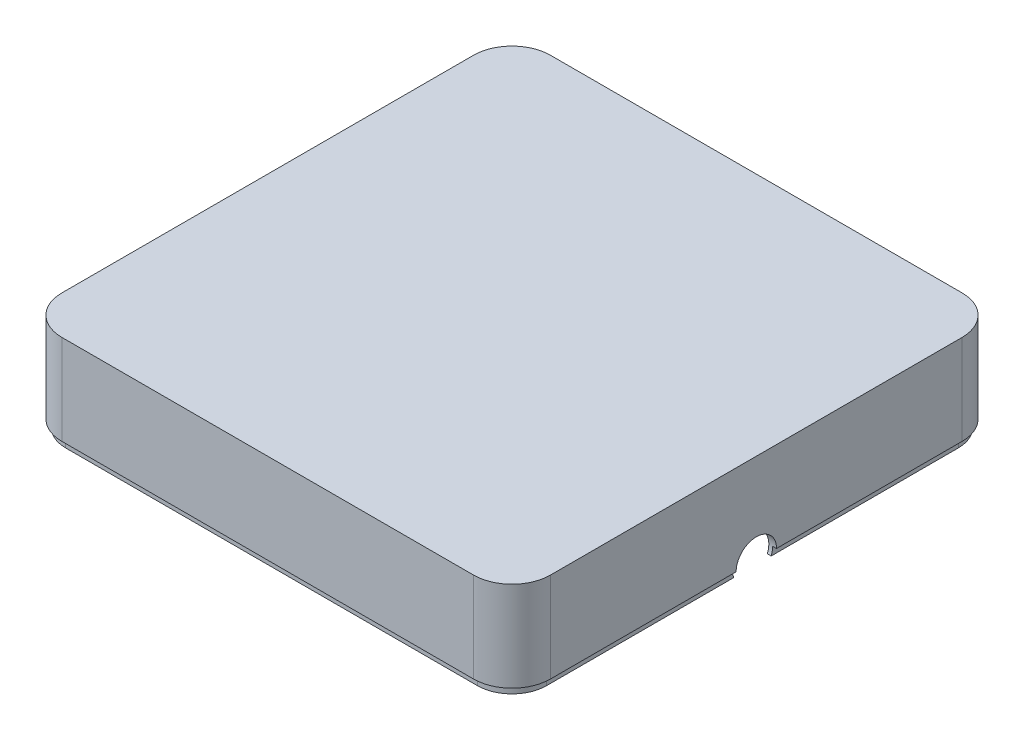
ISO-10303-21;
HEADER;
FILE_DESCRIPTION(('STEP AP214'),'2;1');
FILE_NAME('part.step','',(''),(''),'','','');
FILE_SCHEMA(('AUTOMOTIVE_DESIGN { 1 0 10303 214 1 1 1 1 }'));
ENDSEC;
DATA;
#1=APPLICATION_CONTEXT('core data for automotive mechanical design processes');
#2=APPLICATION_PROTOCOL_DEFINITION('international standard','automotive_design',2000,#1);
#3=PRODUCT_CONTEXT('',#1,'mechanical');
#4=PRODUCT('Part','Part','',(#3));
#5=PRODUCT_RELATED_PRODUCT_CATEGORY('part','',(#4));
#6=PRODUCT_DEFINITION_FORMATION('','',#4);
#7=PRODUCT_DEFINITION_CONTEXT('part definition',#1,'design');
#8=PRODUCT_DEFINITION('design','',#6,#7);
#9=PRODUCT_DEFINITION_SHAPE('','',#8);
#10=(LENGTH_UNIT() NAMED_UNIT(*) SI_UNIT(.MILLI.,.METRE.));
#11=(NAMED_UNIT(*) PLANE_ANGLE_UNIT() SI_UNIT($,.RADIAN.));
#12=(NAMED_UNIT(*) SI_UNIT($,.STERADIAN.) SOLID_ANGLE_UNIT());
#13=UNCERTAINTY_MEASURE_WITH_UNIT(LENGTH_MEASURE(1.E-05),#10,'distance_accuracy_value','');
#14=(GEOMETRIC_REPRESENTATION_CONTEXT(3) GLOBAL_UNCERTAINTY_ASSIGNED_CONTEXT((#13)) GLOBAL_UNIT_ASSIGNED_CONTEXT((#10,
#11,#12)) REPRESENTATION_CONTEXT('',''));
#15=CARTESIAN_POINT('',(0.,0.,0.));
#16=DIRECTION('',(0.,0.,1.));
#17=DIRECTION('',(1.,0.,0.));
#18=AXIS2_PLACEMENT_3D('',#15,#16,#17);
#19=CARTESIAN_POINT('',(0.,-25.4,127.));
#20=DIRECTION('',(0.,1.,0.));
#21=DIRECTION('',(0.,0.,1.));
#22=AXIS2_PLACEMENT_3D('',#19,#20,#21);
#23=PLANE('',#22);
#24=DIRECTION('',(1.,0.,0.));
#25=VECTOR('',#24,1.);
#26=CARTESIAN_POINT('',(0.,-25.4,2.));
#27=LINE('',#26,#25);
#28=CARTESIAN_POINT('',(38.214826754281,-25.4,2.));
#29=VERTEX_POINT('',#28);
#30=CARTESIAN_POINT('',(117.,-25.4,2.));
#31=VERTEX_POINT('',#30);
#32=EDGE_CURVE('E354',#29,#31,#27,.T.);
#33=ORIENTED_EDGE('',*,*,#32,.F.);
#34=DIRECTION('',(0.,0.,1.));
#35=VECTOR('',#34,1.);
#36=CARTESIAN_POINT('',(38.214826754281,-25.4,127.001));
#37=LINE('',#36,#35);
#38=CARTESIAN_POINT('',(38.214826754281,-25.4,1.));
#39=VERTEX_POINT('',#38);
#40=EDGE_CURVE('E506',#39,#29,#37,.T.);
#41=ORIENTED_EDGE('',*,*,#40,.F.);
#42=DIRECTION('',(1.,0.,0.));
#43=VECTOR('',#42,1.);
#44=CARTESIAN_POINT('',(10.,-25.4,1.));
#45=LINE('',#44,#43);
#46=CARTESIAN_POINT('',(117.,-25.4,1.));
#47=VERTEX_POINT('',#46);
#48=EDGE_CURVE('E308',#39,#47,#45,.T.);
#49=ORIENTED_EDGE('',*,*,#48,.T.);
#50=CARTESIAN_POINT('',(117.,-25.4,9.99999999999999));
#51=DIRECTION('',(0.,-1.,0.));
#52=DIRECTION('',(0.,0.,-1.));
#53=AXIS2_PLACEMENT_3D('',#50,#51,#52);
#54=CIRCLE('',#53,8.99999999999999);
#55=CARTESIAN_POINT('',(126.,-25.4,9.99999999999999));
#56=VERTEX_POINT('',#55);
#57=EDGE_CURVE('E311',#47,#56,#54,.T.);
#58=ORIENTED_EDGE('',*,*,#57,.T.);
#59=DIRECTION('',(0.,0.,1.));
#60=VECTOR('',#59,1.);
#61=CARTESIAN_POINT('',(126.,-25.4,9.99999999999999));
#62=LINE('',#61,#60);
#63=CARTESIAN_POINT('',(126.,-25.4,58.6458780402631));
#64=VERTEX_POINT('',#63);
#65=EDGE_CURVE('E315',#56,#64,#62,.T.);
#66=ORIENTED_EDGE('',*,*,#65,.T.);
#67=DIRECTION('',(1.,0.,0.));
#68=VECTOR('',#67,1.);
#69=CARTESIAN_POINT('',(123.,-25.4,58.6458780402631));
#70=LINE('',#69,#68);
#71=CARTESIAN_POINT('',(125.,-25.4,58.6458780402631));
#72=VERTEX_POINT('',#71);
#73=EDGE_CURVE('E516',#64,#72,#70,.F.);
#74=ORIENTED_EDGE('',*,*,#73,.T.);
#75=DIRECTION('',(0.,0.,-1.));
#76=VECTOR('',#75,1.);
#77=CARTESIAN_POINT('',(125.,-25.4,127.));
#78=LINE('',#77,#76);
#79=CARTESIAN_POINT('',(125.,-25.4,9.99999999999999));
#80=VERTEX_POINT('',#79);
#81=EDGE_CURVE('E377',#72,#80,#78,.T.);
#82=ORIENTED_EDGE('',*,*,#81,.T.);
#83=CARTESIAN_POINT('',(117.,-25.4,9.99999999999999));
#84=DIRECTION('',(0.,1.,0.));
#85=DIRECTION('',(0.,0.,1.));
#86=AXIS2_PLACEMENT_3D('',#83,#84,#85);
#87=CIRCLE('',#86,8.);
#88=EDGE_CURVE('E407',#31,#80,#87,.F.);
#89=ORIENTED_EDGE('',*,*,#88,.F.);
#90=EDGE_LOOP('',(#33,#41,#49,#58,#66,#74,#82,#89));
#91=FACE_BOUND('',#90,.T.);
#92=ADVANCED_FACE('F35',(#91),#23,.F.);
#93=CARTESIAN_POINT('',(117.,-23.4,117.));
#94=DIRECTION('',(0.,-1.,0.));
#95=DIRECTION('',(0.,0.,-1.));
#96=AXIS2_PLACEMENT_3D('',#93,#94,#95);
#97=PLANE('',#96);
#98=DIRECTION('',(0.,0.,-1.));
#99=VECTOR('',#98,1.);
#100=CARTESIAN_POINT('',(38.214826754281,-23.4,127.001));
#101=LINE('',#100,#99);
#102=CARTESIAN_POINT('',(38.214826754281,-23.4,1.));
#103=VERTEX_POINT('',#102);
#104=CARTESIAN_POINT('',(38.214826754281,-23.4,0.));
#105=VERTEX_POINT('',#104);
#106=EDGE_CURVE('E274',#103,#105,#101,.T.);
#107=ORIENTED_EDGE('',*,*,#106,.T.);
#108=DIRECTION('',(1.,0.,0.));
#109=VECTOR('',#108,1.);
#110=CARTESIAN_POINT('',(10.,-23.4,0.));
#111=LINE('',#110,#109);
#112=CARTESIAN_POINT('',(117.,-23.4,0.));
#113=VERTEX_POINT('',#112);
#114=EDGE_CURVE('E346',#105,#113,#111,.T.);
#115=ORIENTED_EDGE('',*,*,#114,.T.);
#116=CARTESIAN_POINT('',(117.,-23.4,9.99999999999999));
#117=DIRECTION('',(0.,-1.,0.));
#118=DIRECTION('',(0.,0.,-1.));
#119=AXIS2_PLACEMENT_3D('',#116,#117,#118);
#120=CIRCLE('',#119,9.99999999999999);
#121=CARTESIAN_POINT('',(127.,-23.4,9.99999999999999));
#122=VERTEX_POINT('',#121);
#123=EDGE_CURVE('E348',#113,#122,#120,.T.);
#124=ORIENTED_EDGE('',*,*,#123,.T.);
#125=DIRECTION('',(0.,0.,1.));
#126=VECTOR('',#125,1.);
#127=CARTESIAN_POINT('',(127.,-23.4,9.99999999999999));
#128=LINE('',#127,#126);
#129=CARTESIAN_POINT('',(127.,-23.4,58.25));
#130=VERTEX_POINT('',#129);
#131=EDGE_CURVE('E351',#122,#130,#128,.T.);
#132=ORIENTED_EDGE('',*,*,#131,.T.);
#133=DIRECTION('',(1.,0.,0.));
#134=VECTOR('',#133,1.);
#135=CARTESIAN_POINT('',(123.,-23.4,58.25));
#136=LINE('',#135,#134);
#137=CARTESIAN_POINT('',(126.,-23.4,58.25));
#138=VERTEX_POINT('',#137);
#139=EDGE_CURVE('E58',#138,#130,#136,.T.);
#140=ORIENTED_EDGE('',*,*,#139,.F.);
#141=DIRECTION('',(0.,0.,1.));
#142=VECTOR('',#141,1.);
#143=CARTESIAN_POINT('',(126.,-23.4,9.99999999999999));
#144=LINE('',#143,#142);
#145=CARTESIAN_POINT('',(126.,-23.4,9.99999999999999));
#146=VERTEX_POINT('',#145);
#147=EDGE_CURVE('E288',#146,#138,#144,.T.);
#148=ORIENTED_EDGE('',*,*,#147,.F.);
#149=CARTESIAN_POINT('',(117.,-23.4,9.99999999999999));
#150=DIRECTION('',(0.,-1.,0.));
#151=DIRECTION('',(0.,0.,-1.));
#152=AXIS2_PLACEMENT_3D('',#149,#150,#151);
#153=CIRCLE('',#152,8.99999999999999);
#154=CARTESIAN_POINT('',(117.,-23.4,1.));
#155=VERTEX_POINT('',#154);
#156=EDGE_CURVE('E278',#155,#146,#153,.T.);
#157=ORIENTED_EDGE('',*,*,#156,.F.);
#158=DIRECTION('',(1.,0.,0.));
#159=VECTOR('',#158,1.);
#160=CARTESIAN_POINT('',(10.,-23.4,1.));
#161=LINE('',#160,#159);
#162=EDGE_CURVE('E279',#103,#155,#161,.T.);
#163=ORIENTED_EDGE('',*,*,#162,.F.);
#164=EDGE_LOOP('',(#107,#115,#124,#132,#140,#148,#157,#163));
#165=FACE_BOUND('',#164,.T.);
#166=ADVANCED_FACE('F562',(#165),#97,.T.);
#167=CARTESIAN_POINT('',(10.,-23.4,1.));
#168=DIRECTION('',(0.,0.,-1.));
#169=DIRECTION('',(-1.,0.,0.));
#170=AXIS2_PLACEMENT_3D('',#167,#168,#169);
#171=PLANE('',#170);
#172=DIRECTION('',(0.,1.,0.));
#173=VECTOR('',#172,1.);
#174=CARTESIAN_POINT('',(38.214826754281,-42.6075234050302,1.));
#175=LINE('',#174,#173);
#176=EDGE_CURVE('E505',#39,#103,#175,.T.);
#177=ORIENTED_EDGE('',*,*,#176,.T.);
#178=ORIENTED_EDGE('',*,*,#162,.T.);
#179=DIRECTION('',(0.,-1.,0.));
#180=VECTOR('',#179,1.);
#181=CARTESIAN_POINT('',(117.,-23.4,1.));
#182=LINE('',#181,#180);
#183=EDGE_CURVE('E325',#155,#47,#182,.T.);
#184=ORIENTED_EDGE('',*,*,#183,.T.);
#185=ORIENTED_EDGE('',*,*,#48,.F.);
#186=EDGE_LOOP('',(#177,#178,#184,#185));
#187=FACE_BOUND('',#186,.T.);
#188=ADVANCED_FACE('F587',(#187),#171,.T.);
#189=CARTESIAN_POINT('',(126.,-23.4,9.99999999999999));
#190=DIRECTION('',(1.,0.,0.));
#191=DIRECTION('',(0.,0.,-1.));
#192=AXIS2_PLACEMENT_3D('',#189,#190,#191);
#193=PLANE('',#192);
#194=CARTESIAN_POINT('',(126.,-23.4,63.5));
#195=DIRECTION('',(1.,0.,0.));
#196=DIRECTION('',(0.,0.,-1.));
#197=AXIS2_PLACEMENT_3D('',#194,#195,#196);
#198=CIRCLE('',#197,5.25);
#199=CARTESIAN_POINT('',(126.,-23.4,68.75));
#200=VERTEX_POINT('',#199);
#201=CARTESIAN_POINT('',(126.,-25.4,68.3541219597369));
#202=VERTEX_POINT('',#201);
#203=EDGE_CURVE('E514',#200,#202,#198,.T.);
#204=ORIENTED_EDGE('',*,*,#203,.F.);
#205=CARTESIAN_POINT('',(126.,-23.4,117.));
#206=VERTEX_POINT('',#205);
#207=EDGE_CURVE('E282',#200,#206,#144,.T.);
#208=ORIENTED_EDGE('',*,*,#207,.T.);
#209=DIRECTION('',(0.,-1.,0.));
#210=VECTOR('',#209,1.);
#211=CARTESIAN_POINT('',(126.,-23.4,117.));
#212=LINE('',#211,#210);
#213=CARTESIAN_POINT('',(126.,-25.4,117.));
#214=VERTEX_POINT('',#213);
#215=EDGE_CURVE('E319',#206,#214,#212,.T.);
#216=ORIENTED_EDGE('',*,*,#215,.T.);
#217=EDGE_CURVE('E314',#202,#214,#62,.T.);
#218=ORIENTED_EDGE('',*,*,#217,.F.);
#219=EDGE_LOOP('',(#204,#208,#216,#218));
#220=FACE_BOUND('',#219,.T.);
#221=ADVANCED_FACE('F556',(#220),#193,.T.);
#222=CARTESIAN_POINT('',(10.,-25.4,1.));
#223=VERTEX_POINT('',#222);
#224=CARTESIAN_POINT('',(23.214826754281,-25.4,1.));
#225=VERTEX_POINT('',#224);
#226=EDGE_CURVE('E309',#223,#225,#45,.T.);
#227=ORIENTED_EDGE('',*,*,#226,.T.);
#228=DIRECTION('',(0.,0.,-1.));
#229=VECTOR('',#228,1.);
#230=CARTESIAN_POINT('',(23.214826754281,-25.4,127.001));
#231=LINE('',#230,#229);
#232=CARTESIAN_POINT('',(23.214826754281,-25.4,2.));
#233=VERTEX_POINT('',#232);
#234=EDGE_CURVE('E257',#233,#225,#231,.T.);
#235=ORIENTED_EDGE('',*,*,#234,.F.);
#236=CARTESIAN_POINT('',(10.,-25.4,2.));
#237=VERTEX_POINT('',#236);
#238=EDGE_CURVE('E382',#237,#233,#27,.T.);
#239=ORIENTED_EDGE('',*,*,#238,.F.);
#240=CARTESIAN_POINT('',(10.,-25.4,9.99999999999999));
#241=DIRECTION('',(0.,1.,0.));
#242=DIRECTION('',(0.,0.,1.));
#243=AXIS2_PLACEMENT_3D('',#240,#241,#242);
#244=CIRCLE('',#243,8.);
#245=CARTESIAN_POINT('',(2.,-25.4,9.99999999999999));
#246=VERTEX_POINT('',#245);
#247=EDGE_CURVE('E405',#246,#237,#244,.F.);
#248=ORIENTED_EDGE('',*,*,#247,.F.);
#249=DIRECTION('',(0.,0.,-1.));
#250=VECTOR('',#249,1.);
#251=CARTESIAN_POINT('',(2.,-25.4,127.));
#252=LINE('',#251,#250);
#253=CARTESIAN_POINT('',(2.,-25.4,117.));
#254=VERTEX_POINT('',#253);
#255=EDGE_CURVE('E399',#254,#246,#252,.T.);
#256=ORIENTED_EDGE('',*,*,#255,.F.);
#257=CARTESIAN_POINT('',(10.,-25.4,117.));
#258=DIRECTION('',(0.,1.,0.));
#259=DIRECTION('',(0.,0.,1.));
#260=AXIS2_PLACEMENT_3D('',#257,#258,#259);
#261=CIRCLE('',#260,8.);
#262=CARTESIAN_POINT('',(10.,-25.4,125.));
#263=VERTEX_POINT('',#262);
#264=EDGE_CURVE('E365',#263,#254,#261,.F.);
#265=ORIENTED_EDGE('',*,*,#264,.F.);
#266=DIRECTION('',(1.,0.,0.));
#267=VECTOR('',#266,1.);
#268=CARTESIAN_POINT('',(0.,-25.4,125.));
#269=LINE('',#268,#267);
#270=CARTESIAN_POINT('',(117.,-25.4,125.));
#271=VERTEX_POINT('',#270);
#272=EDGE_CURVE('E372',#263,#271,#269,.T.);
#273=ORIENTED_EDGE('',*,*,#272,.T.);
#274=CARTESIAN_POINT('',(117.,-25.4,117.));
#275=DIRECTION('',(0.,1.,0.));
#276=DIRECTION('',(0.,0.,1.));
#277=AXIS2_PLACEMENT_3D('',#274,#275,#276);
#278=CIRCLE('',#277,8.);
#279=CARTESIAN_POINT('',(125.,-25.4,117.));
#280=VERTEX_POINT('',#279);
#281=EDGE_CURVE('E401',#280,#271,#278,.F.);
#282=ORIENTED_EDGE('',*,*,#281,.F.);
#283=CARTESIAN_POINT('',(125.,-25.4,68.3541219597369));
#284=VERTEX_POINT('',#283);
#285=EDGE_CURVE('E404',#280,#284,#78,.T.);
#286=ORIENTED_EDGE('',*,*,#285,.T.);
#287=DIRECTION('',(1.,0.,0.));
#288=VECTOR('',#287,1.);
#289=CARTESIAN_POINT('',(123.,-25.4,68.3541219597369));
#290=LINE('',#289,#288);
#291=EDGE_CURVE('E521',#284,#202,#290,.T.);
#292=ORIENTED_EDGE('',*,*,#291,.T.);
#293=ORIENTED_EDGE('',*,*,#217,.T.);
#294=CARTESIAN_POINT('',(117.,-25.4,117.));
#295=DIRECTION('',(0.,-1.,0.));
#296=DIRECTION('',(0.,0.,-1.));
#297=AXIS2_PLACEMENT_3D('',#294,#295,#296);
#298=CIRCLE('',#297,8.99999999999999);
#299=CARTESIAN_POINT('',(117.,-25.4,126.));
#300=VERTEX_POINT('',#299);
#301=EDGE_CURVE('E292',#214,#300,#298,.T.);
#302=ORIENTED_EDGE('',*,*,#301,.T.);
#303=DIRECTION('',(-1.,0.,0.));
#304=VECTOR('',#303,1.);
#305=CARTESIAN_POINT('',(117.,-25.4,126.));
#306=LINE('',#305,#304);
#307=CARTESIAN_POINT('',(10.,-25.4,126.));
#308=VERTEX_POINT('',#307);
#309=EDGE_CURVE('E295',#300,#308,#306,.T.);
#310=ORIENTED_EDGE('',*,*,#309,.T.);
#311=CARTESIAN_POINT('',(10.,-25.4,117.));
#312=DIRECTION('',(0.,-1.,0.));
#313=DIRECTION('',(0.,0.,-1.));
#314=AXIS2_PLACEMENT_3D('',#311,#312,#313);
#315=CIRCLE('',#314,9.);
#316=CARTESIAN_POINT('',(1.00000000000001,-25.4,117.));
#317=VERTEX_POINT('',#316);
#318=EDGE_CURVE('E299',#308,#317,#315,.T.);
#319=ORIENTED_EDGE('',*,*,#318,.T.);
#320=DIRECTION('',(0.,0.,-1.));
#321=VECTOR('',#320,1.);
#322=CARTESIAN_POINT('',(1.00000000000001,-25.4,117.));
#323=LINE('',#322,#321);
#324=CARTESIAN_POINT('',(1.,-25.4,9.99999999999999));
#325=VERTEX_POINT('',#324);
#326=EDGE_CURVE('E302',#317,#325,#323,.T.);
#327=ORIENTED_EDGE('',*,*,#326,.T.);
#328=CARTESIAN_POINT('',(10.,-25.4,9.99999999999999));
#329=DIRECTION('',(0.,-1.,0.));
#330=DIRECTION('',(0.,0.,-1.));
#331=AXIS2_PLACEMENT_3D('',#328,#329,#330);
#332=CIRCLE('',#331,9.);
#333=EDGE_CURVE('E305',#325,#223,#332,.T.);
#334=ORIENTED_EDGE('',*,*,#333,.T.);
#335=EDGE_LOOP('',(#227,#235,#239,#248,#256,#265,#273,#282,#286,#292,#293,#302,#310,#319,#327,#334));
#336=FACE_BOUND('',#335,.T.);
#337=ADVANCED_FACE('F583',(#336),#23,.F.);
#338=CARTESIAN_POINT('',(2.,0.,127.));
#339=DIRECTION('',(1.,0.,0.));
#340=DIRECTION('',(0.,1.,0.));
#341=AXIS2_PLACEMENT_3D('',#338,#339,#340);
#342=PLANE('',#341);
#343=ORIENTED_EDGE('',*,*,#255,.T.);
#344=DIRECTION('',(0.,1.,0.));
#345=VECTOR('',#344,1.);
#346=CARTESIAN_POINT('',(2.,0.,9.99999999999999));
#347=LINE('',#346,#345);
#348=CARTESIAN_POINT('',(2.,-2.,9.99999999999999));
#349=VERTEX_POINT('',#348);
#350=EDGE_CURVE('E358',#349,#246,#347,.F.);
#351=ORIENTED_EDGE('',*,*,#350,.F.);
#352=DIRECTION('',(0.,0.,-1.));
#353=VECTOR('',#352,1.);
#354=CARTESIAN_POINT('',(2.,-2.,127.));
#355=LINE('',#354,#353);
#356=CARTESIAN_POINT('',(2.,-2.,117.));
#357=VERTEX_POINT('',#356);
#358=EDGE_CURVE('E359',#357,#349,#355,.T.);
#359=ORIENTED_EDGE('',*,*,#358,.F.);
#360=DIRECTION('',(0.,1.,0.));
#361=VECTOR('',#360,1.);
#362=CARTESIAN_POINT('',(2.,0.,117.));
#363=LINE('',#362,#361);
#364=EDGE_CURVE('E355',#254,#357,#363,.T.);
#365=ORIENTED_EDGE('',*,*,#364,.F.);
#366=EDGE_LOOP('',(#343,#351,#359,#365));
#367=FACE_BOUND('',#366,.T.);
#368=ADVANCED_FACE('F592',(#367),#342,.T.);
#369=CARTESIAN_POINT('',(125.,0.,127.));
#370=DIRECTION('',(-1.,0.,0.));
#371=DIRECTION('',(0.,0.,1.));
#372=AXIS2_PLACEMENT_3D('',#369,#370,#371);
#373=PLANE('',#372);
#374=CARTESIAN_POINT('',(125.,-23.4,63.5));
#375=DIRECTION('',(-1.,0.,0.));
#376=DIRECTION('',(0.,0.,1.));
#377=AXIS2_PLACEMENT_3D('',#374,#375,#376);
#378=CIRCLE('',#377,5.25);
#379=EDGE_CURVE('E519',#284,#72,#378,.T.);
#380=ORIENTED_EDGE('',*,*,#379,.F.);
#381=ORIENTED_EDGE('',*,*,#285,.F.);
#382=DIRECTION('',(0.,1.,0.));
#383=VECTOR('',#382,1.);
#384=CARTESIAN_POINT('',(125.,0.,117.));
#385=LINE('',#384,#383);
#386=CARTESIAN_POINT('',(125.,-2.,117.));
#387=VERTEX_POINT('',#386);
#388=EDGE_CURVE('E388',#387,#280,#385,.F.);
#389=ORIENTED_EDGE('',*,*,#388,.F.);
#390=DIRECTION('',(0.,0.,-1.));
#391=VECTOR('',#390,1.);
#392=CARTESIAN_POINT('',(125.,-2.,127.));
#393=LINE('',#392,#391);
#394=CARTESIAN_POINT('',(125.,-2.,9.99999999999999));
#395=VERTEX_POINT('',#394);
#396=EDGE_CURVE('E362',#387,#395,#393,.T.);
#397=ORIENTED_EDGE('',*,*,#396,.T.);
#398=DIRECTION('',(0.,1.,0.));
#399=VECTOR('',#398,1.);
#400=CARTESIAN_POINT('',(125.,0.,9.99999999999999));
#401=LINE('',#400,#399);
#402=EDGE_CURVE('E384',#80,#395,#401,.T.);
#403=ORIENTED_EDGE('',*,*,#402,.F.);
#404=ORIENTED_EDGE('',*,*,#81,.F.);
#405=EDGE_LOOP('',(#380,#381,#389,#397,#403,#404));
#406=FACE_BOUND('',#405,.T.);
#407=ADVANCED_FACE('F598',(#406),#373,.T.);
#408=CARTESIAN_POINT('',(0.,-2.,127.));
#409=DIRECTION('',(0.,-1.,0.));
#410=DIRECTION('',(0.,0.,-1.));
#411=AXIS2_PLACEMENT_3D('',#408,#409,#410);
#412=PLANE('',#411);
#413=ORIENTED_EDGE('',*,*,#358,.T.);
#414=CARTESIAN_POINT('',(10.,-2.,9.99999999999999));
#415=DIRECTION('',(0.,-1.,0.));
#416=DIRECTION('',(0.,0.,-1.));
#417=AXIS2_PLACEMENT_3D('',#414,#415,#416);
#418=CIRCLE('',#417,8.);
#419=CARTESIAN_POINT('',(10.,-2.,2.));
#420=VERTEX_POINT('',#419);
#421=EDGE_CURVE('E369',#420,#349,#418,.F.);
#422=ORIENTED_EDGE('',*,*,#421,.F.);
#423=DIRECTION('',(-1.,0.,0.));
#424=VECTOR('',#423,1.);
#425=CARTESIAN_POINT('',(0.,-2.,2.));
#426=LINE('',#425,#424);
#427=CARTESIAN_POINT('',(117.,-2.,2.));
#428=VERTEX_POINT('',#427);
#429=EDGE_CURVE('E379',#428,#420,#426,.T.);
#430=ORIENTED_EDGE('',*,*,#429,.F.);
#431=CARTESIAN_POINT('',(117.,-2.,9.99999999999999));
#432=DIRECTION('',(0.,-1.,0.));
#433=DIRECTION('',(0.,0.,-1.));
#434=AXIS2_PLACEMENT_3D('',#431,#432,#433);
#435=CIRCLE('',#434,8.);
#436=EDGE_CURVE('E374',#395,#428,#435,.F.);
#437=ORIENTED_EDGE('',*,*,#436,.F.);
#438=ORIENTED_EDGE('',*,*,#396,.F.);
#439=CARTESIAN_POINT('',(117.,-2.,117.));
#440=DIRECTION('',(0.,-1.,0.));
#441=DIRECTION('',(0.,0.,-1.));
#442=AXIS2_PLACEMENT_3D('',#439,#440,#441);
#443=CIRCLE('',#442,8.);
#444=CARTESIAN_POINT('',(117.,-2.,125.));
#445=VERTEX_POINT('',#444);
#446=EDGE_CURVE('E357',#445,#387,#443,.F.);
#447=ORIENTED_EDGE('',*,*,#446,.F.);
#448=DIRECTION('',(-1.,0.,0.));
#449=VECTOR('',#448,1.);
#450=CARTESIAN_POINT('',(0.,-2.,125.));
#451=LINE('',#450,#449);
#452=CARTESIAN_POINT('',(10.,-2.,125.));
#453=VERTEX_POINT('',#452);
#454=EDGE_CURVE('E363',#445,#453,#451,.T.);
#455=ORIENTED_EDGE('',*,*,#454,.T.);
#456=CARTESIAN_POINT('',(10.,-2.,117.));
#457=DIRECTION('',(0.,-1.,0.));
#458=DIRECTION('',(0.,0.,-1.));
#459=AXIS2_PLACEMENT_3D('',#456,#457,#458);
#460=CIRCLE('',#459,8.);
#461=EDGE_CURVE('E366',#357,#453,#460,.F.);
#462=ORIENTED_EDGE('',*,*,#461,.F.);
#463=EDGE_LOOP('',(#413,#422,#430,#437,#438,#447,#455,#462));
#464=FACE_BOUND('',#463,.T.);
#465=ADVANCED_FACE('F621',(#464),#412,.T.);
#466=CARTESIAN_POINT('',(0.,0.,125.));
#467=DIRECTION('',(0.,0.,1.));
#468=DIRECTION('',(1.,0.,0.));
#469=AXIS2_PLACEMENT_3D('',#466,#467,#468);
#470=PLANE('',#469);
#471=ORIENTED_EDGE('',*,*,#454,.F.);
#472=DIRECTION('',(0.,1.,0.));
#473=VECTOR('',#472,1.);
#474=CARTESIAN_POINT('',(117.,0.,125.));
#475=LINE('',#474,#473);
#476=EDGE_CURVE('E395',#271,#445,#475,.T.);
#477=ORIENTED_EDGE('',*,*,#476,.F.);
#478=ORIENTED_EDGE('',*,*,#272,.F.);
#479=DIRECTION('',(0.,1.,0.));
#480=VECTOR('',#479,1.);
#481=CARTESIAN_POINT('',(10.,0.,125.));
#482=LINE('',#481,#480);
#483=EDGE_CURVE('E398',#453,#263,#482,.F.);
#484=ORIENTED_EDGE('',*,*,#483,.F.);
#485=EDGE_LOOP('',(#471,#477,#478,#484));
#486=FACE_BOUND('',#485,.T.);
#487=ADVANCED_FACE('F625',(#486),#470,.F.);
#488=CARTESIAN_POINT('',(0.,0.,2.));
#489=DIRECTION('',(0.,0.,1.));
#490=DIRECTION('',(1.,0.,0.));
#491=AXIS2_PLACEMENT_3D('',#488,#489,#490);
#492=PLANE('',#491);
#493=DIRECTION('',(0.,-1.,0.));
#494=VECTOR('',#493,1.);
#495=CARTESIAN_POINT('',(38.214826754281,-42.6075234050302,2.));
#496=LINE('',#495,#494);
#497=CARTESIAN_POINT('',(38.214826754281,-7.60752340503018,2.));
#498=VERTEX_POINT('',#497);
#499=EDGE_CURVE('E273',#498,#29,#496,.T.);
#500=ORIENTED_EDGE('',*,*,#499,.T.);
#501=ORIENTED_EDGE('',*,*,#32,.T.);
#502=DIRECTION('',(0.,1.,0.));
#503=VECTOR('',#502,1.);
#504=CARTESIAN_POINT('',(117.,0.,2.));
#505=LINE('',#504,#503);
#506=EDGE_CURVE('E368',#428,#31,#505,.F.);
#507=ORIENTED_EDGE('',*,*,#506,.F.);
#508=ORIENTED_EDGE('',*,*,#429,.T.);
#509=DIRECTION('',(0.,1.,0.));
#510=VECTOR('',#509,1.);
#511=CARTESIAN_POINT('',(10.,0.,2.));
#512=LINE('',#511,#510);
#513=EDGE_CURVE('E391',#237,#420,#512,.T.);
#514=ORIENTED_EDGE('',*,*,#513,.F.);
#515=ORIENTED_EDGE('',*,*,#238,.T.);
#516=DIRECTION('',(0.,1.,0.));
#517=VECTOR('',#516,1.);
#518=CARTESIAN_POINT('',(23.214826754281,-42.6075234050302,2.));
#519=LINE('',#518,#517);
#520=CARTESIAN_POINT('',(23.214826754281,-7.60752340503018,2.));
#521=VERTEX_POINT('',#520);
#522=EDGE_CURVE('E262',#233,#521,#519,.T.);
#523=ORIENTED_EDGE('',*,*,#522,.T.);
#524=DIRECTION('',(1.,0.,0.));
#525=VECTOR('',#524,1.);
#526=CARTESIAN_POINT('',(23.214826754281,-7.60752340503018,2.));
#527=LINE('',#526,#525);
#528=EDGE_CURVE('E501',#521,#498,#527,.T.);
#529=ORIENTED_EDGE('',*,*,#528,.T.);
#530=EDGE_LOOP('',(#500,#501,#507,#508,#514,#515,#523,#529));
#531=FACE_BOUND('',#530,.T.);
#532=ADVANCED_FACE('F629',(#531),#492,.T.);
#533=CARTESIAN_POINT('',(10.,0.,117.));
#534=DIRECTION('',(0.,1.,0.));
#535=DIRECTION('',(-1.,0.,0.));
#536=AXIS2_PLACEMENT_3D('',#533,#534,#535);
#537=CYLINDRICAL_SURFACE('',#536,8.);
#538=ORIENTED_EDGE('',*,*,#461,.T.);
#539=ORIENTED_EDGE('',*,*,#483,.T.);
#540=ORIENTED_EDGE('',*,*,#264,.T.);
#541=ORIENTED_EDGE('',*,*,#364,.T.);
#542=EDGE_LOOP('',(#538,#539,#540,#541));
#543=FACE_BOUND('',#542,.T.);
#544=ADVANCED_FACE('F633',(#543),#537,.F.);
#545=CARTESIAN_POINT('',(10.,0.,9.99999999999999));
#546=DIRECTION('',(0.,-1.,0.));
#547=DIRECTION('',(1.,0.,0.));
#548=AXIS2_PLACEMENT_3D('',#545,#546,#547);
#549=CYLINDRICAL_SURFACE('',#548,8.);
#550=ORIENTED_EDGE('',*,*,#421,.T.);
#551=ORIENTED_EDGE('',*,*,#350,.T.);
#552=ORIENTED_EDGE('',*,*,#247,.T.);
#553=ORIENTED_EDGE('',*,*,#513,.T.);
#554=EDGE_LOOP('',(#550,#551,#552,#553));
#555=FACE_BOUND('',#554,.T.);
#556=ADVANCED_FACE('F637',(#555),#549,.F.);
#557=CARTESIAN_POINT('',(117.,0.,9.99999999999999));
#558=DIRECTION('',(0.,1.,0.));
#559=DIRECTION('',(0.,0.,1.));
#560=AXIS2_PLACEMENT_3D('',#557,#558,#559);
#561=CYLINDRICAL_SURFACE('',#560,8.);
#562=ORIENTED_EDGE('',*,*,#88,.T.);
#563=ORIENTED_EDGE('',*,*,#402,.T.);
#564=ORIENTED_EDGE('',*,*,#436,.T.);
#565=ORIENTED_EDGE('',*,*,#506,.T.);
#566=EDGE_LOOP('',(#562,#563,#564,#565));
#567=FACE_BOUND('',#566,.T.);
#568=ADVANCED_FACE('F641',(#567),#561,.F.);
#569=CARTESIAN_POINT('',(117.,0.,117.));
#570=DIRECTION('',(0.,-1.,0.));
#571=DIRECTION('',(0.,0.,-1.));
#572=AXIS2_PLACEMENT_3D('',#569,#570,#571);
#573=CYLINDRICAL_SURFACE('',#572,8.);
#574=ORIENTED_EDGE('',*,*,#281,.T.);
#575=ORIENTED_EDGE('',*,*,#476,.T.);
#576=ORIENTED_EDGE('',*,*,#446,.T.);
#577=ORIENTED_EDGE('',*,*,#388,.T.);
#578=EDGE_LOOP('',(#574,#575,#576,#577));
#579=FACE_BOUND('',#578,.T.);
#580=ADVANCED_FACE('F617',(#579),#573,.F.);
#581=DIRECTION('',(0.,0.,1.));
#582=VECTOR('',#581,1.);
#583=CARTESIAN_POINT('',(23.214826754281,-23.4,127.001));
#584=LINE('',#583,#582);
#585=CARTESIAN_POINT('',(23.214826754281,-23.4,0.));
#586=VERTEX_POINT('',#585);
#587=CARTESIAN_POINT('',(23.214826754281,-23.4,1.));
#588=VERTEX_POINT('',#587);
#589=EDGE_CURVE('E50',#586,#588,#584,.T.);
#590=ORIENTED_EDGE('',*,*,#589,.T.);
#591=CARTESIAN_POINT('',(10.,-23.4,1.));
#592=VERTEX_POINT('',#591);
#593=EDGE_CURVE('E269',#592,#588,#161,.T.);
#594=ORIENTED_EDGE('',*,*,#593,.F.);
#595=CARTESIAN_POINT('',(10.,-23.4,9.99999999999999));
#596=DIRECTION('',(0.,-1.,0.));
#597=DIRECTION('',(0.,0.,-1.));
#598=AXIS2_PLACEMENT_3D('',#595,#596,#597);
#599=CIRCLE('',#598,9.);
#600=CARTESIAN_POINT('',(1.,-23.4,9.99999999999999));
#601=VERTEX_POINT('',#600);
#602=EDGE_CURVE('E284',#601,#592,#599,.T.);
#603=ORIENTED_EDGE('',*,*,#602,.F.);
#604=DIRECTION('',(0.,0.,-1.));
#605=VECTOR('',#604,1.);
#606=CARTESIAN_POINT('',(1.00000000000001,-23.4,117.));
#607=LINE('',#606,#605);
#608=CARTESIAN_POINT('',(1.00000000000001,-23.4,117.));
#609=VERTEX_POINT('',#608);
#610=EDGE_CURVE('E532',#609,#601,#607,.T.);
#611=ORIENTED_EDGE('',*,*,#610,.F.);
#612=CARTESIAN_POINT('',(10.,-23.4,117.));
#613=DIRECTION('',(0.,-1.,0.));
#614=DIRECTION('',(0.,0.,-1.));
#615=AXIS2_PLACEMENT_3D('',#612,#613,#614);
#616=CIRCLE('',#615,9.);
#617=CARTESIAN_POINT('',(10.,-23.4,126.));
#618=VERTEX_POINT('',#617);
#619=EDGE_CURVE('E530',#618,#609,#616,.T.);
#620=ORIENTED_EDGE('',*,*,#619,.F.);
#621=DIRECTION('',(-1.,0.,0.));
#622=VECTOR('',#621,1.);
#623=CARTESIAN_POINT('',(117.,-23.4,126.));
#624=LINE('',#623,#622);
#625=CARTESIAN_POINT('',(117.,-23.4,126.));
#626=VERTEX_POINT('',#625);
#627=EDGE_CURVE('E527',#626,#618,#624,.T.);
#628=ORIENTED_EDGE('',*,*,#627,.F.);
#629=CARTESIAN_POINT('',(117.,-23.4,117.));
#630=DIRECTION('',(0.,-1.,0.));
#631=DIRECTION('',(0.,0.,-1.));
#632=AXIS2_PLACEMENT_3D('',#629,#630,#631);
#633=CIRCLE('',#632,8.99999999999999);
#634=EDGE_CURVE('E318',#206,#626,#633,.T.);
#635=ORIENTED_EDGE('',*,*,#634,.F.);
#636=ORIENTED_EDGE('',*,*,#207,.F.);
#637=DIRECTION('',(1.,0.,0.));
#638=VECTOR('',#637,1.);
#639=CARTESIAN_POINT('',(123.,-23.4,68.75));
#640=LINE('',#639,#638);
#641=CARTESIAN_POINT('',(127.,-23.4,68.75));
#642=VERTEX_POINT('',#641);
#643=EDGE_CURVE('E296',#642,#200,#640,.F.);
#644=ORIENTED_EDGE('',*,*,#643,.F.);
#645=CARTESIAN_POINT('',(127.,-23.4,117.));
#646=VERTEX_POINT('',#645);
#647=EDGE_CURVE('E350',#642,#646,#128,.T.);
#648=ORIENTED_EDGE('',*,*,#647,.T.);
#649=CARTESIAN_POINT('',(117.,-23.4,117.));
#650=DIRECTION('',(0.,-1.,0.));
#651=DIRECTION('',(0.,0.,-1.));
#652=AXIS2_PLACEMENT_3D('',#649,#650,#651);
#653=CIRCLE('',#652,9.99999999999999);
#654=CARTESIAN_POINT('',(117.,-23.4,127.));
#655=VERTEX_POINT('',#654);
#656=EDGE_CURVE('E322',#646,#655,#653,.T.);
#657=ORIENTED_EDGE('',*,*,#656,.T.);
#658=DIRECTION('',(-1.,0.,0.));
#659=VECTOR('',#658,1.);
#660=CARTESIAN_POINT('',(117.,-23.4,127.));
#661=LINE('',#660,#659);
#662=CARTESIAN_POINT('',(10.,-23.4,127.));
#663=VERTEX_POINT('',#662);
#664=EDGE_CURVE('E338',#655,#663,#661,.T.);
#665=ORIENTED_EDGE('',*,*,#664,.T.);
#666=CARTESIAN_POINT('',(10.,-23.4,117.));
#667=DIRECTION('',(0.,-1.,0.));
#668=DIRECTION('',(0.,0.,-1.));
#669=AXIS2_PLACEMENT_3D('',#666,#667,#668);
#670=CIRCLE('',#669,10.);
#671=CARTESIAN_POINT('',(0.,-23.4,117.));
#672=VERTEX_POINT('',#671);
#673=EDGE_CURVE('E340',#663,#672,#670,.T.);
#674=ORIENTED_EDGE('',*,*,#673,.T.);
#675=DIRECTION('',(0.,0.,-1.));
#676=VECTOR('',#675,1.);
#677=CARTESIAN_POINT('',(0.,-23.4,117.));
#678=LINE('',#677,#676);
#679=CARTESIAN_POINT('',(0.,-23.4,9.99999999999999));
#680=VERTEX_POINT('',#679);
#681=EDGE_CURVE('E342',#672,#680,#678,.T.);
#682=ORIENTED_EDGE('',*,*,#681,.T.);
#683=CARTESIAN_POINT('',(10.,-23.4,9.99999999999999));
#684=DIRECTION('',(0.,-1.,0.));
#685=DIRECTION('',(0.,0.,-1.));
#686=AXIS2_PLACEMENT_3D('',#683,#684,#685);
#687=CIRCLE('',#686,10.);
#688=CARTESIAN_POINT('',(10.,-23.4,0.));
#689=VERTEX_POINT('',#688);
#690=EDGE_CURVE('E344',#680,#689,#687,.T.);
#691=ORIENTED_EDGE('',*,*,#690,.T.);
#692=EDGE_CURVE('E272',#689,#586,#111,.T.);
#693=ORIENTED_EDGE('',*,*,#692,.T.);
#694=EDGE_LOOP('',(#590,#594,#603,#611,#620,#628,#635,#636,#644,#648,#657,#665,#674,#682,#691,#693));
#695=FACE_BOUND('',#694,.T.);
#696=ADVANCED_FACE('F267',(#695),#97,.T.);
#697=CARTESIAN_POINT('',(117.,-23.4,117.));
#698=DIRECTION('',(0.,-1.,0.));
#699=DIRECTION('',(0.,0.,-1.));
#700=AXIS2_PLACEMENT_3D('',#697,#698,#699);
#701=CYLINDRICAL_SURFACE('',#700,8.99999999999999);
#702=ORIENTED_EDGE('',*,*,#301,.F.);
#703=ORIENTED_EDGE('',*,*,#215,.F.);
#704=ORIENTED_EDGE('',*,*,#634,.T.);
#705=DIRECTION('',(0.,-1.,0.));
#706=VECTOR('',#705,1.);
#707=CARTESIAN_POINT('',(117.,-23.4,126.));
#708=LINE('',#707,#706);
#709=EDGE_CURVE('E291',#626,#300,#708,.T.);
#710=ORIENTED_EDGE('',*,*,#709,.T.);
#711=EDGE_LOOP('',(#702,#703,#704,#710));
#712=FACE_BOUND('',#711,.T.);
#713=ADVANCED_FACE('F552',(#712),#701,.T.);
#714=EDGE_CURVE('E512',#64,#138,#198,.T.);
#715=ORIENTED_EDGE('',*,*,#714,.F.);
#716=ORIENTED_EDGE('',*,*,#65,.F.);
#717=DIRECTION('',(0.,-1.,0.));
#718=VECTOR('',#717,1.);
#719=CARTESIAN_POINT('',(126.,-23.4,9.99999999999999));
#720=LINE('',#719,#718);
#721=EDGE_CURVE('E323',#146,#56,#720,.T.);
#722=ORIENTED_EDGE('',*,*,#721,.F.);
#723=ORIENTED_EDGE('',*,*,#147,.T.);
#724=EDGE_LOOP('',(#715,#716,#722,#723));
#725=FACE_BOUND('',#724,.T.);
#726=ADVANCED_FACE('F602',(#725),#193,.T.);
#727=CARTESIAN_POINT('',(117.,-23.4,9.99999999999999));
#728=DIRECTION('',(0.,-1.,0.));
#729=DIRECTION('',(0.,0.,-1.));
#730=AXIS2_PLACEMENT_3D('',#727,#728,#729);
#731=CYLINDRICAL_SURFACE('',#730,8.99999999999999);
#732=ORIENTED_EDGE('',*,*,#57,.F.);
#733=ORIENTED_EDGE('',*,*,#183,.F.);
#734=ORIENTED_EDGE('',*,*,#156,.T.);
#735=ORIENTED_EDGE('',*,*,#721,.T.);
#736=EDGE_LOOP('',(#732,#733,#734,#735));
#737=FACE_BOUND('',#736,.T.);
#738=ADVANCED_FACE('F676',(#737),#731,.T.);
#739=DIRECTION('',(0.,-1.,0.));
#740=VECTOR('',#739,1.);
#741=CARTESIAN_POINT('',(23.214826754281,-42.6075234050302,1.));
#742=LINE('',#741,#740);
#743=EDGE_CURVE('E254',#588,#225,#742,.T.);
#744=ORIENTED_EDGE('',*,*,#743,.T.);
#745=ORIENTED_EDGE('',*,*,#226,.F.);
#746=DIRECTION('',(0.,-1.,0.));
#747=VECTOR('',#746,1.);
#748=CARTESIAN_POINT('',(10.,-23.4,1.));
#749=LINE('',#748,#747);
#750=EDGE_CURVE('E277',#592,#223,#749,.T.);
#751=ORIENTED_EDGE('',*,*,#750,.F.);
#752=ORIENTED_EDGE('',*,*,#593,.T.);
#753=EDGE_LOOP('',(#744,#745,#751,#752));
#754=FACE_BOUND('',#753,.T.);
#755=ADVANCED_FACE('F276',(#754),#171,.T.);
#756=CARTESIAN_POINT('',(10.,-23.4,9.99999999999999));
#757=DIRECTION('',(0.,-1.,0.));
#758=DIRECTION('',(0.,0.,-1.));
#759=AXIS2_PLACEMENT_3D('',#756,#757,#758);
#760=CYLINDRICAL_SURFACE('',#759,9.);
#761=ORIENTED_EDGE('',*,*,#333,.F.);
#762=DIRECTION('',(0.,-1.,0.));
#763=VECTOR('',#762,1.);
#764=CARTESIAN_POINT('',(1.,-23.4,9.99999999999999));
#765=LINE('',#764,#763);
#766=EDGE_CURVE('E329',#601,#325,#765,.T.);
#767=ORIENTED_EDGE('',*,*,#766,.F.);
#768=ORIENTED_EDGE('',*,*,#602,.T.);
#769=ORIENTED_EDGE('',*,*,#750,.T.);
#770=EDGE_LOOP('',(#761,#767,#768,#769));
#771=FACE_BOUND('',#770,.T.);
#772=ADVANCED_FACE('F538',(#771),#760,.T.);
#773=CARTESIAN_POINT('',(1.00000000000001,-23.4,117.));
#774=DIRECTION('',(-1.,0.,0.));
#775=DIRECTION('',(0.,0.,1.));
#776=AXIS2_PLACEMENT_3D('',#773,#774,#775);
#777=PLANE('',#776);
#778=ORIENTED_EDGE('',*,*,#326,.F.);
#779=DIRECTION('',(0.,-1.,0.));
#780=VECTOR('',#779,1.);
#781=CARTESIAN_POINT('',(1.00000000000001,-23.4,117.));
#782=LINE('',#781,#780);
#783=EDGE_CURVE('E331',#609,#317,#782,.T.);
#784=ORIENTED_EDGE('',*,*,#783,.F.);
#785=ORIENTED_EDGE('',*,*,#610,.T.);
#786=ORIENTED_EDGE('',*,*,#766,.T.);
#787=EDGE_LOOP('',(#778,#784,#785,#786));
#788=FACE_BOUND('',#787,.T.);
#789=ADVANCED_FACE('F604',(#788),#777,.T.);
#790=CARTESIAN_POINT('',(10.,-23.4,117.));
#791=DIRECTION('',(0.,-1.,0.));
#792=DIRECTION('',(0.,0.,-1.));
#793=AXIS2_PLACEMENT_3D('',#790,#791,#792);
#794=CYLINDRICAL_SURFACE('',#793,9.);
#795=ORIENTED_EDGE('',*,*,#318,.F.);
#796=DIRECTION('',(0.,-1.,0.));
#797=VECTOR('',#796,1.);
#798=CARTESIAN_POINT('',(10.,-23.4,126.));
#799=LINE('',#798,#797);
#800=EDGE_CURVE('E333',#618,#308,#799,.T.);
#801=ORIENTED_EDGE('',*,*,#800,.F.);
#802=ORIENTED_EDGE('',*,*,#619,.T.);
#803=ORIENTED_EDGE('',*,*,#783,.T.);
#804=EDGE_LOOP('',(#795,#801,#802,#803));
#805=FACE_BOUND('',#804,.T.);
#806=ADVANCED_FACE('F542',(#805),#794,.T.);
#807=CARTESIAN_POINT('',(117.,-23.4,126.));
#808=DIRECTION('',(0.,0.,1.));
#809=DIRECTION('',(1.,0.,0.));
#810=AXIS2_PLACEMENT_3D('',#807,#808,#809);
#811=PLANE('',#810);
#812=ORIENTED_EDGE('',*,*,#309,.F.);
#813=ORIENTED_EDGE('',*,*,#709,.F.);
#814=ORIENTED_EDGE('',*,*,#627,.T.);
#815=ORIENTED_EDGE('',*,*,#800,.T.);
#816=EDGE_LOOP('',(#812,#813,#814,#815));
#817=FACE_BOUND('',#816,.T.);
#818=ADVANCED_FACE('F546',(#817),#811,.T.);
#819=CARTESIAN_POINT('',(0.,0.,127.));
#820=DIRECTION('',(0.,-1.,0.));
#821=DIRECTION('',(0.,0.,-1.));
#822=AXIS2_PLACEMENT_3D('',#819,#820,#821);
#823=PLANE('',#822);
#824=DIRECTION('',(0.,0.,-1.));
#825=VECTOR('',#824,1.);
#826=CARTESIAN_POINT('',(0.,0.,127.));
#827=LINE('',#826,#825);
#828=CARTESIAN_POINT('',(0.,0.,117.));
#829=VERTEX_POINT('',#828);
#830=CARTESIAN_POINT('',(0.,0.,9.99999999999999));
#831=VERTEX_POINT('',#830);
#832=EDGE_CURVE('E421',#829,#831,#827,.T.);
#833=ORIENTED_EDGE('',*,*,#832,.F.);
#834=CARTESIAN_POINT('',(10.,0.,117.));
#835=DIRECTION('',(0.,-1.,0.));
#836=DIRECTION('',(0.,0.,-1.));
#837=AXIS2_PLACEMENT_3D('',#834,#835,#836);
#838=CIRCLE('',#837,10.);
#839=CARTESIAN_POINT('',(10.,0.,127.));
#840=VERTEX_POINT('',#839);
#841=EDGE_CURVE('E445',#829,#840,#838,.F.);
#842=ORIENTED_EDGE('',*,*,#841,.T.);
#843=DIRECTION('',(-1.,0.,0.));
#844=VECTOR('',#843,1.);
#845=CARTESIAN_POINT('',(0.,0.,127.));
#846=LINE('',#845,#844);
#847=CARTESIAN_POINT('',(117.,0.,127.));
#848=VERTEX_POINT('',#847);
#849=EDGE_CURVE('E418',#848,#840,#846,.T.);
#850=ORIENTED_EDGE('',*,*,#849,.F.);
#851=CARTESIAN_POINT('',(117.,0.,117.));
#852=DIRECTION('',(0.,-1.,0.));
#853=DIRECTION('',(0.,0.,-1.));
#854=AXIS2_PLACEMENT_3D('',#851,#852,#853);
#855=CIRCLE('',#854,10.);
#856=CARTESIAN_POINT('',(127.,0.,117.));
#857=VERTEX_POINT('',#856);
#858=EDGE_CURVE('E439',#848,#857,#855,.F.);
#859=ORIENTED_EDGE('',*,*,#858,.T.);
#860=DIRECTION('',(0.,0.,-1.));
#861=VECTOR('',#860,1.);
#862=CARTESIAN_POINT('',(127.,0.,127.));
#863=LINE('',#862,#861);
#864=CARTESIAN_POINT('',(127.,0.,9.99999999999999));
#865=VERTEX_POINT('',#864);
#866=EDGE_CURVE('E426',#857,#865,#863,.T.);
#867=ORIENTED_EDGE('',*,*,#866,.T.);
#868=CARTESIAN_POINT('',(117.,0.,9.99999999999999));
#869=DIRECTION('',(0.,-1.,0.));
#870=DIRECTION('',(0.,0.,-1.));
#871=AXIS2_PLACEMENT_3D('',#868,#869,#870);
#872=CIRCLE('',#871,10.);
#873=CARTESIAN_POINT('',(117.,0.,0.));
#874=VERTEX_POINT('',#873);
#875=EDGE_CURVE('E441',#865,#874,#872,.F.);
#876=ORIENTED_EDGE('',*,*,#875,.T.);
#877=DIRECTION('',(-1.,0.,0.));
#878=VECTOR('',#877,1.);
#879=CARTESIAN_POINT('',(0.,0.,0.));
#880=LINE('',#879,#878);
#881=CARTESIAN_POINT('',(10.,0.,0.));
#882=VERTEX_POINT('',#881);
#883=EDGE_CURVE('E387',#874,#882,#880,.T.);
#884=ORIENTED_EDGE('',*,*,#883,.T.);
#885=CARTESIAN_POINT('',(10.,0.,9.99999999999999));
#886=DIRECTION('',(0.,-1.,0.));
#887=DIRECTION('',(0.,0.,-1.));
#888=AXIS2_PLACEMENT_3D('',#885,#886,#887);
#889=CIRCLE('',#888,10.);
#890=EDGE_CURVE('E443',#882,#831,#889,.F.);
#891=ORIENTED_EDGE('',*,*,#890,.T.);
#892=EDGE_LOOP('',(#833,#842,#850,#859,#867,#876,#884,#891));
#893=FACE_BOUND('',#892,.T.);
#894=ADVANCED_FACE('F570',(#893),#823,.F.);
#895=CARTESIAN_POINT('',(117.,0.,117.));
#896=DIRECTION('',(0.,-1.,0.));
#897=DIRECTION('',(0.,0.,-1.));
#898=AXIS2_PLACEMENT_3D('',#895,#896,#897);
#899=CYLINDRICAL_SURFACE('',#898,10.);
#900=DIRECTION('',(0.,1.,0.));
#901=VECTOR('',#900,1.);
#902=CARTESIAN_POINT('',(117.,0.,127.));
#903=LINE('',#902,#901);
#904=EDGE_CURVE('E429',#655,#848,#903,.T.);
#905=ORIENTED_EDGE('',*,*,#904,.F.);
#906=ORIENTED_EDGE('',*,*,#656,.F.);
#907=DIRECTION('',(0.,1.,0.));
#908=VECTOR('',#907,1.);
#909=CARTESIAN_POINT('',(127.,-25.4,117.));
#910=LINE('',#909,#908);
#911=EDGE_CURVE('E43',#857,#646,#910,.F.);
#912=ORIENTED_EDGE('',*,*,#911,.F.);
#913=ORIENTED_EDGE('',*,*,#858,.F.);
#914=EDGE_LOOP('',(#905,#906,#912,#913));
#915=FACE_BOUND('',#914,.T.);
#916=ADVANCED_FACE('F37',(#915),#899,.T.);
#917=CARTESIAN_POINT('',(10.,0.,117.));
#918=DIRECTION('',(0.,1.,0.));
#919=DIRECTION('',(-1.,0.,0.));
#920=AXIS2_PLACEMENT_3D('',#917,#918,#919);
#921=CYLINDRICAL_SURFACE('',#920,10.);
#922=DIRECTION('',(0.,-1.,0.));
#923=VECTOR('',#922,1.);
#924=CARTESIAN_POINT('',(0.,0.,117.));
#925=LINE('',#924,#923);
#926=EDGE_CURVE('E437',#672,#829,#925,.F.);
#927=ORIENTED_EDGE('',*,*,#926,.F.);
#928=ORIENTED_EDGE('',*,*,#673,.F.);
#929=DIRECTION('',(0.,-1.,0.));
#930=VECTOR('',#929,1.);
#931=CARTESIAN_POINT('',(10.,-25.4,127.));
#932=LINE('',#931,#930);
#933=EDGE_CURVE('E431',#840,#663,#932,.T.);
#934=ORIENTED_EDGE('',*,*,#933,.F.);
#935=ORIENTED_EDGE('',*,*,#841,.F.);
#936=EDGE_LOOP('',(#927,#928,#934,#935));
#937=FACE_BOUND('',#936,.T.);
#938=ADVANCED_FACE('F471',(#937),#921,.T.);
#939=CARTESIAN_POINT('',(0.,0.,127.));
#940=DIRECTION('',(0.,0.,1.));
#941=DIRECTION('',(1.,0.,0.));
#942=AXIS2_PLACEMENT_3D('',#939,#940,#941);
#943=PLANE('',#942);
#944=ORIENTED_EDGE('',*,*,#933,.T.);
#945=ORIENTED_EDGE('',*,*,#664,.F.);
#946=ORIENTED_EDGE('',*,*,#904,.T.);
#947=ORIENTED_EDGE('',*,*,#849,.T.);
#948=EDGE_LOOP('',(#944,#945,#946,#947));
#949=FACE_BOUND('',#948,.T.);
#950=ADVANCED_FACE('F466',(#949),#943,.T.);
#951=CARTESIAN_POINT('',(117.,0.,9.99999999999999));
#952=DIRECTION('',(0.,1.,0.));
#953=DIRECTION('',(0.,0.,1.));
#954=AXIS2_PLACEMENT_3D('',#951,#952,#953);
#955=CYLINDRICAL_SURFACE('',#954,10.);
#956=DIRECTION('',(0.,1.,0.));
#957=VECTOR('',#956,1.);
#958=CARTESIAN_POINT('',(127.,0.,9.99999999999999));
#959=LINE('',#958,#957);
#960=EDGE_CURVE('E11',#122,#865,#959,.T.);
#961=ORIENTED_EDGE('',*,*,#960,.F.);
#962=ORIENTED_EDGE('',*,*,#123,.F.);
#963=DIRECTION('',(0.,1.,0.));
#964=VECTOR('',#963,1.);
#965=CARTESIAN_POINT('',(117.,0.,0.));
#966=LINE('',#965,#964);
#967=EDGE_CURVE('E447',#874,#113,#966,.F.);
#968=ORIENTED_EDGE('',*,*,#967,.F.);
#969=ORIENTED_EDGE('',*,*,#875,.F.);
#970=EDGE_LOOP('',(#961,#962,#968,#969));
#971=FACE_BOUND('',#970,.T.);
#972=ADVANCED_FACE('F567',(#971),#955,.T.);
#973=CARTESIAN_POINT('',(10.,0.,9.99999999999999));
#974=DIRECTION('',(0.,-1.,0.));
#975=DIRECTION('',(1.,0.,0.));
#976=AXIS2_PLACEMENT_3D('',#973,#974,#975);
#977=CYLINDRICAL_SURFACE('',#976,10.);
#978=DIRECTION('',(0.,-1.,0.));
#979=VECTOR('',#978,1.);
#980=CARTESIAN_POINT('',(10.,0.,0.));
#981=LINE('',#980,#979);
#982=EDGE_CURVE('E450',#689,#882,#981,.F.);
#983=ORIENTED_EDGE('',*,*,#982,.F.);
#984=ORIENTED_EDGE('',*,*,#690,.F.);
#985=DIRECTION('',(0.,-1.,0.));
#986=VECTOR('',#985,1.);
#987=CARTESIAN_POINT('',(0.,0.,9.99999999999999));
#988=LINE('',#987,#986);
#989=EDGE_CURVE('E434',#831,#680,#988,.T.);
#990=ORIENTED_EDGE('',*,*,#989,.F.);
#991=ORIENTED_EDGE('',*,*,#890,.F.);
#992=EDGE_LOOP('',(#983,#984,#990,#991));
#993=FACE_BOUND('',#992,.T.);
#994=ADVANCED_FACE('F481',(#993),#977,.T.);
#995=CARTESIAN_POINT('',(0.,0.,0.));
#996=DIRECTION('',(0.,0.,1.));
#997=DIRECTION('',(1.,0.,0.));
#998=AXIS2_PLACEMENT_3D('',#995,#996,#997);
#999=PLANE('',#998);
#1000=ORIENTED_EDGE('',*,*,#114,.F.);
#1001=DIRECTION('',(0.,-1.,0.));
#1002=VECTOR('',#1001,1.);
#1003=CARTESIAN_POINT('',(38.214826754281,-42.6075234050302,0.));
#1004=LINE('',#1003,#1002);
#1005=CARTESIAN_POINT('',(38.214826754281,-7.60752340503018,0.));
#1006=VERTEX_POINT('',#1005);
#1007=EDGE_CURVE('E493',#1006,#105,#1004,.T.);
#1008=ORIENTED_EDGE('',*,*,#1007,.F.);
#1009=DIRECTION('',(1.,0.,0.));
#1010=VECTOR('',#1009,1.);
#1011=CARTESIAN_POINT('',(23.214826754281,-7.60752340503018,0.));
#1012=LINE('',#1011,#1010);
#1013=CARTESIAN_POINT('',(23.214826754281,-7.60752340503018,0.));
#1014=VERTEX_POINT('',#1013);
#1015=EDGE_CURVE('E490',#1014,#1006,#1012,.T.);
#1016=ORIENTED_EDGE('',*,*,#1015,.F.);
#1017=DIRECTION('',(0.,1.,0.));
#1018=VECTOR('',#1017,1.);
#1019=CARTESIAN_POINT('',(23.214826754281,-42.6075234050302,0.));
#1020=LINE('',#1019,#1018);
#1021=EDGE_CURVE('E487',#586,#1014,#1020,.T.);
#1022=ORIENTED_EDGE('',*,*,#1021,.F.);
#1023=ORIENTED_EDGE('',*,*,#692,.F.);
#1024=ORIENTED_EDGE('',*,*,#982,.T.);
#1025=ORIENTED_EDGE('',*,*,#883,.F.);
#1026=ORIENTED_EDGE('',*,*,#967,.T.);
#1027=EDGE_LOOP('',(#1000,#1008,#1016,#1022,#1023,#1024,#1025,#1026));
#1028=FACE_BOUND('',#1027,.T.);
#1029=ADVANCED_FACE('F484',(#1028),#999,.F.);
#1030=CARTESIAN_POINT('',(127.,0.,127.));
#1031=DIRECTION('',(-1.,0.,0.));
#1032=DIRECTION('',(0.,0.,1.));
#1033=AXIS2_PLACEMENT_3D('',#1030,#1031,#1032);
#1034=PLANE('',#1033);
#1035=ORIENTED_EDGE('',*,*,#647,.F.);
#1036=CARTESIAN_POINT('',(127.,-23.4,63.5));
#1037=DIRECTION('',(1.,0.,0.));
#1038=DIRECTION('',(0.,0.,-1.));
#1039=AXIS2_PLACEMENT_3D('',#1036,#1037,#1038);
#1040=CIRCLE('',#1039,5.25);
#1041=EDGE_CURVE('E508',#130,#642,#1040,.T.);
#1042=ORIENTED_EDGE('',*,*,#1041,.F.);
#1043=ORIENTED_EDGE('',*,*,#131,.F.);
#1044=ORIENTED_EDGE('',*,*,#960,.T.);
#1045=ORIENTED_EDGE('',*,*,#866,.F.);
#1046=ORIENTED_EDGE('',*,*,#911,.T.);
#1047=EDGE_LOOP('',(#1035,#1042,#1043,#1044,#1045,#1046));
#1048=FACE_BOUND('',#1047,.T.);
#1049=ADVANCED_FACE('F456',(#1048),#1034,.F.);
#1050=CARTESIAN_POINT('',(0.,0.,127.));
#1051=DIRECTION('',(1.,0.,0.));
#1052=DIRECTION('',(0.,1.,0.));
#1053=AXIS2_PLACEMENT_3D('',#1050,#1051,#1052);
#1054=PLANE('',#1053);
#1055=ORIENTED_EDGE('',*,*,#681,.F.);
#1056=ORIENTED_EDGE('',*,*,#926,.T.);
#1057=ORIENTED_EDGE('',*,*,#832,.T.);
#1058=ORIENTED_EDGE('',*,*,#989,.T.);
#1059=EDGE_LOOP('',(#1055,#1056,#1057,#1058));
#1060=FACE_BOUND('',#1059,.T.);
#1061=ADVANCED_FACE('F475',(#1060),#1054,.F.);
#1062=CARTESIAN_POINT('',(123.,-23.4,63.5));
#1063=DIRECTION('',(1.,0.,0.));
#1064=DIRECTION('',(0.,0.,-1.));
#1065=AXIS2_PLACEMENT_3D('',#1062,#1063,#1064);
#1066=CYLINDRICAL_SURFACE('',#1065,5.25);
#1067=ORIENTED_EDGE('',*,*,#643,.T.);
#1068=ORIENTED_EDGE('',*,*,#203,.T.);
#1069=ORIENTED_EDGE('',*,*,#291,.F.);
#1070=ORIENTED_EDGE('',*,*,#379,.T.);
#1071=ORIENTED_EDGE('',*,*,#73,.F.);
#1072=ORIENTED_EDGE('',*,*,#714,.T.);
#1073=ORIENTED_EDGE('',*,*,#139,.T.);
#1074=ORIENTED_EDGE('',*,*,#1041,.T.);
#1075=EDGE_LOOP('',(#1067,#1068,#1069,#1070,#1071,#1072,#1073,#1074));
#1076=FACE_BOUND('',#1075,.T.);
#1077=ADVANCED_FACE('F557',(#1076),#1066,.F.);
#1078=CARTESIAN_POINT('',(23.214826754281,-7.60752340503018,127.001));
#1079=DIRECTION('',(0.,1.,0.));
#1080=DIRECTION('',(0.,0.,1.));
#1081=AXIS2_PLACEMENT_3D('',#1078,#1079,#1080);
#1082=PLANE('',#1081);
#1083=DIRECTION('',(0.,0.,-1.));
#1084=VECTOR('',#1083,1.);
#1085=CARTESIAN_POINT('',(23.214826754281,-7.60752340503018,127.001));
#1086=LINE('',#1085,#1084);
#1087=EDGE_CURVE('E498',#521,#1014,#1086,.T.);
#1088=ORIENTED_EDGE('',*,*,#1087,.T.);
#1089=ORIENTED_EDGE('',*,*,#1015,.T.);
#1090=DIRECTION('',(0.,0.,-1.));
#1091=VECTOR('',#1090,1.);
#1092=CARTESIAN_POINT('',(38.214826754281,-7.60752340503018,127.001));
#1093=LINE('',#1092,#1091);
#1094=EDGE_CURVE('E499',#498,#1006,#1093,.T.);
#1095=ORIENTED_EDGE('',*,*,#1094,.F.);
#1096=ORIENTED_EDGE('',*,*,#528,.F.);
#1097=EDGE_LOOP('',(#1088,#1089,#1095,#1096));
#1098=FACE_BOUND('',#1097,.T.);
#1099=ADVANCED_FACE('F665',(#1098),#1082,.F.);
#1100=CARTESIAN_POINT('',(38.214826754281,-42.6075234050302,127.001));
#1101=DIRECTION('',(1.,0.,0.));
#1102=DIRECTION('',(0.,0.,-1.));
#1103=AXIS2_PLACEMENT_3D('',#1100,#1101,#1102);
#1104=PLANE('',#1103);
#1105=ORIENTED_EDGE('',*,*,#1094,.T.);
#1106=ORIENTED_EDGE('',*,*,#1007,.T.);
#1107=ORIENTED_EDGE('',*,*,#106,.F.);
#1108=ORIENTED_EDGE('',*,*,#176,.F.);
#1109=ORIENTED_EDGE('',*,*,#40,.T.);
#1110=ORIENTED_EDGE('',*,*,#499,.F.);
#1111=EDGE_LOOP('',(#1105,#1106,#1107,#1108,#1109,#1110));
#1112=FACE_BOUND('',#1111,.T.);
#1113=ADVANCED_FACE('F670',(#1112),#1104,.F.);
#1114=CARTESIAN_POINT('',(23.214826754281,-42.6075234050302,127.001));
#1115=DIRECTION('',(-1.,0.,0.));
#1116=DIRECTION('',(0.,0.,1.));
#1117=AXIS2_PLACEMENT_3D('',#1114,#1115,#1116);
#1118=PLANE('',#1117);
#1119=ORIENTED_EDGE('',*,*,#234,.T.);
#1120=ORIENTED_EDGE('',*,*,#743,.F.);
#1121=ORIENTED_EDGE('',*,*,#589,.F.);
#1122=ORIENTED_EDGE('',*,*,#1021,.T.);
#1123=ORIENTED_EDGE('',*,*,#1087,.F.);
#1124=ORIENTED_EDGE('',*,*,#522,.F.);
#1125=EDGE_LOOP('',(#1119,#1120,#1121,#1122,#1123,#1124));
#1126=FACE_BOUND('',#1125,.T.);
#1127=ADVANCED_FACE('F255',(#1126),#1118,.F.);
#1128=CLOSED_SHELL('',(#92,#166,#188,#221,#337,#368,#407,#465,#487,#532,#544,#556,#568,#580,
#696,#713,#726,#738,#755,#772,#789,#806,#818,#894,#916,#938,#950,#972,#994,#1029,#1049,#1061,
#1077,#1099,#1113,#1127));
#1129=MANIFOLD_SOLID_BREP('B2',#1128);
#1130=ADVANCED_BREP_SHAPE_REPRESENTATION('',(#18,#1129),#14);
#1131=SHAPE_DEFINITION_REPRESENTATION(#9,#1130);
ENDSEC;
END-ISO-10303-21;
